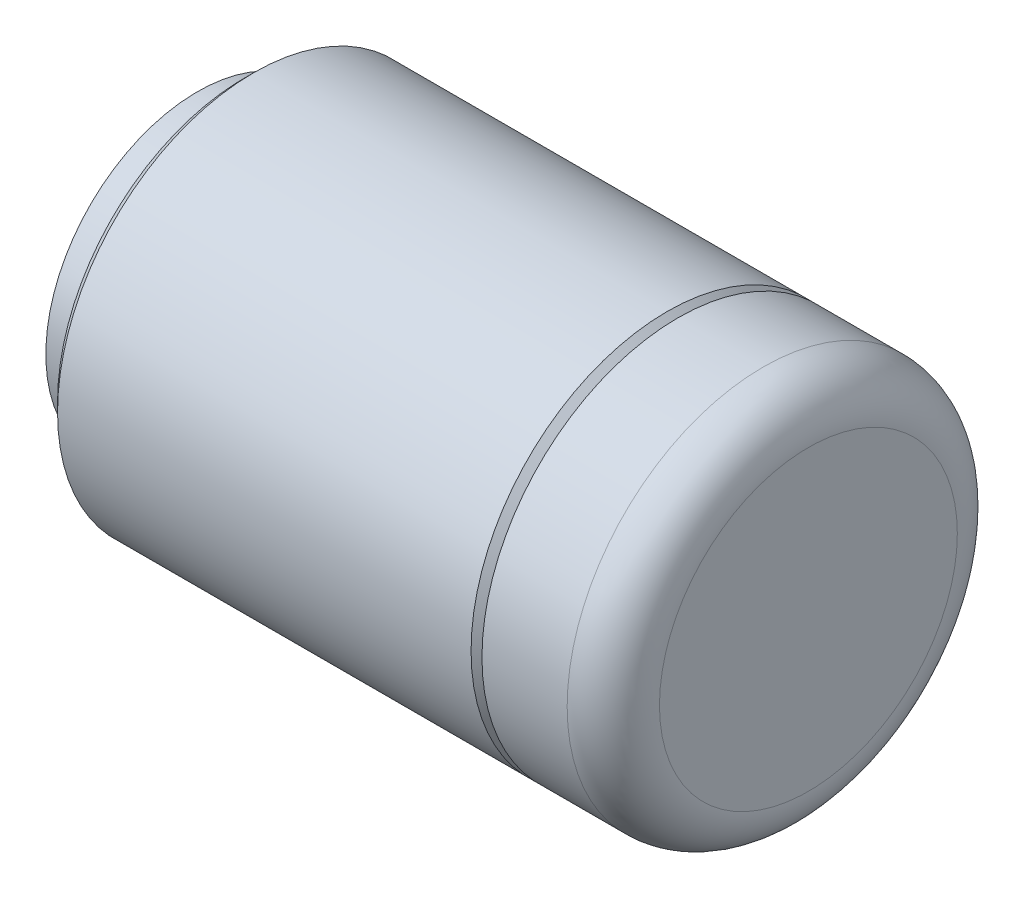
ISO-10303-21;
HEADER;
FILE_DESCRIPTION(('STEP AP214'),'2;1');
FILE_NAME('part.step','',(''),(''),'','','');
FILE_SCHEMA(('AUTOMOTIVE_DESIGN { 1 0 10303 214 1 1 1 1 }'));
ENDSEC;
DATA;
#1=APPLICATION_CONTEXT('core data for automotive mechanical design processes');
#2=APPLICATION_PROTOCOL_DEFINITION('international standard','automotive_design',2000,#1);
#3=PRODUCT_CONTEXT('',#1,'mechanical');
#4=PRODUCT('Part','Part','',(#3));
#5=PRODUCT_RELATED_PRODUCT_CATEGORY('part','',(#4));
#6=PRODUCT_DEFINITION_FORMATION('','',#4);
#7=PRODUCT_DEFINITION_CONTEXT('part definition',#1,'design');
#8=PRODUCT_DEFINITION('design','',#6,#7);
#9=PRODUCT_DEFINITION_SHAPE('','',#8);
#10=(LENGTH_UNIT() NAMED_UNIT(*) SI_UNIT(.MILLI.,.METRE.));
#11=(NAMED_UNIT(*) PLANE_ANGLE_UNIT() SI_UNIT($,.RADIAN.));
#12=(NAMED_UNIT(*) SI_UNIT($,.STERADIAN.) SOLID_ANGLE_UNIT());
#13=UNCERTAINTY_MEASURE_WITH_UNIT(LENGTH_MEASURE(1.E-05),#10,'distance_accuracy_value','');
#14=(GEOMETRIC_REPRESENTATION_CONTEXT(3) GLOBAL_UNCERTAINTY_ASSIGNED_CONTEXT((#13)) GLOBAL_UNIT_ASSIGNED_CONTEXT((#10,
#11,#12)) REPRESENTATION_CONTEXT('',''));
#15=CARTESIAN_POINT('',(0.,0.,0.));
#16=DIRECTION('',(0.,0.,1.));
#17=DIRECTION('',(1.,0.,0.));
#18=AXIS2_PLACEMENT_3D('',#15,#16,#17);
#19=CARTESIAN_POINT('',(155.999999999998,0.,34.9999999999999));
#20=DIRECTION('',(-1.,0.,0.));
#21=DIRECTION('',(0.,0.,1.));
#22=AXIS2_PLACEMENT_3D('',#19,#20,#21);
#23=PLANE('',#22);
#24=CARTESIAN_POINT('',(155.999999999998,0.,0.));
#25=DIRECTION('',(1.,0.,0.));
#26=DIRECTION('',(0.,0.,-1.));
#27=AXIS2_PLACEMENT_3D('',#24,#25,#26);
#28=CIRCLE('',#27,69.9999999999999);
#29=CARTESIAN_POINT('',(155.999999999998,0.,-69.9999999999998));
#30=VERTEX_POINT('',#29);
#31=EDGE_CURVE('E18',#30,#30,#28,.T.);
#32=ORIENTED_EDGE('',*,*,#31,.F.);
#33=EDGE_LOOP('',(#32));
#34=FACE_BOUND('',#33,.T.);
#35=ADVANCED_FACE('F14',(#34),#23,.T.);
#36=CARTESIAN_POINT('',(155.999999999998,0.,0.));
#37=DIRECTION('',(1.,0.,0.));
#38=DIRECTION('',(0.,0.,-1.));
#39=AXIS2_PLACEMENT_3D('',#36,#37,#38);
#40=CYLINDRICAL_SURFACE('',#39,69.9999999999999);
#41=CARTESIAN_POINT('',(166.999999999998,0.,0.));
#42=DIRECTION('',(1.,0.,0.));
#43=DIRECTION('',(0.,0.,1.));
#44=AXIS2_PLACEMENT_3D('',#41,#42,#43);
#45=CIRCLE('',#44,69.9999999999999);
#46=CARTESIAN_POINT('',(166.999999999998,0.,69.9999999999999));
#47=VERTEX_POINT('',#46);
#48=EDGE_CURVE('E30',#47,#47,#45,.T.);
#49=ORIENTED_EDGE('',*,*,#48,.F.);
#50=EDGE_LOOP('',(#49));
#51=FACE_BOUND('',#50,.T.);
#52=ORIENTED_EDGE('',*,*,#31,.T.);
#53=EDGE_LOOP('',(#52));
#54=FACE_BOUND('',#53,.T.);
#55=ADVANCED_FACE('F46',(#51,#54),#40,.T.);
#56=CARTESIAN_POINT('',(177.758875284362,0.,0.));
#57=DIRECTION('',(1.,0.,0.));
#58=DIRECTION('',(0.,0.,-1.));
#59=AXIS2_PLACEMENT_3D('',#56,#57,#58);
#60=CONICAL_SURFACE('',#59,84.350199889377,0.927463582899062);
#61=CARTESIAN_POINT('',(177.758875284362,0.,0.));
#62=DIRECTION('',(1.,0.,0.));
#63=DIRECTION('',(0.,0.,-1.));
#64=AXIS2_PLACEMENT_3D('',#61,#62,#63);
#65=CIRCLE('',#64,84.350199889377);
#66=CARTESIAN_POINT('',(177.758875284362,0.,-84.350199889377));
#67=VERTEX_POINT('',#66);
#68=EDGE_CURVE('E36',#67,#67,#65,.T.);
#69=ORIENTED_EDGE('',*,*,#68,.F.);
#70=EDGE_LOOP('',(#69));
#71=FACE_BOUND('',#70,.T.);
#72=ORIENTED_EDGE('',*,*,#48,.T.);
#73=EDGE_LOOP('',(#72));
#74=FACE_BOUND('',#73,.T.);
#75=ADVANCED_FACE('F53',(#71,#74),#60,.T.);
#76=CARTESIAN_POINT('',(177.758875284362,0.,85.3533239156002));
#77=DIRECTION('',(-1.,0.,0.));
#78=DIRECTION('',(0.,0.,1.));
#79=AXIS2_PLACEMENT_3D('',#76,#77,#78);
#80=PLANE('',#79);
#81=ORIENTED_EDGE('',*,*,#68,.T.);
#82=EDGE_LOOP('',(#81));
#83=FACE_BOUND('',#82,.T.);
#84=CARTESIAN_POINT('',(177.758875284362,0.,0.));
#85=DIRECTION('',(1.,0.,0.));
#86=DIRECTION('',(0.,0.,-1.));
#87=AXIS2_PLACEMENT_3D('',#84,#85,#86);
#88=CIRCLE('',#87,86.3564479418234);
#89=CARTESIAN_POINT('',(177.758875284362,0.,-86.3564479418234));
#90=VERTEX_POINT('',#89);
#91=EDGE_CURVE('E33',#90,#90,#88,.T.);
#92=ORIENTED_EDGE('',*,*,#91,.F.);
#93=EDGE_LOOP('',(#92));
#94=FACE_BOUND('',#93,.T.);
#95=ADVANCED_FACE('F109',(#83,#94),#80,.T.);
#96=CARTESIAN_POINT('',(437.99999999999,0.,34.3753541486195));
#97=DIRECTION('',(1.,0.,0.));
#98=DIRECTION('',(0.,0.,-1.));
#99=AXIS2_PLACEMENT_3D('',#96,#97,#98);
#100=PLANE('',#99);
#101=CARTESIAN_POINT('',(437.999999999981,0.,0.));
#102=DIRECTION('',(-1.,0.,0.));
#103=DIRECTION('',(0.,0.,1.));
#104=AXIS2_PLACEMENT_3D('',#101,#102,#103);
#105=CIRCLE('',#104,68.750708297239);
#106=CARTESIAN_POINT('',(437.999999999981,0.,68.7507082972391));
#107=VERTEX_POINT('',#106);
#108=EDGE_CURVE('E35',#107,#107,#105,.T.);
#109=ORIENTED_EDGE('',*,*,#108,.F.);
#110=EDGE_LOOP('',(#109));
#111=FACE_BOUND('',#110,.T.);
#112=ADVANCED_FACE('F107',(#111),#100,.T.);
#113=CARTESIAN_POINT('',(181.90242734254,0.,0.));
#114=DIRECTION('',(1.,0.,0.));
#115=DIRECTION('',(0.,0.,-1.));
#116=AXIS2_PLACEMENT_3D('',#113,#114,#115);
#117=CONICAL_SURFACE('',#116,90.4999999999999,0.785398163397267);
#118=CARTESIAN_POINT('',(181.90242734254,0.,0.));
#119=DIRECTION('',(1.,0.,0.));
#120=DIRECTION('',(0.,0.,1.));
#121=AXIS2_PLACEMENT_3D('',#118,#119,#120);
#122=CIRCLE('',#121,90.4999999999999);
#123=CARTESIAN_POINT('',(181.90242734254,0.,90.4999999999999));
#124=VERTEX_POINT('',#123);
#125=EDGE_CURVE('E93',#124,#124,#122,.T.);
#126=ORIENTED_EDGE('',*,*,#125,.F.);
#127=EDGE_LOOP('',(#126));
#128=FACE_BOUND('',#127,.T.);
#129=ORIENTED_EDGE('',*,*,#91,.T.);
#130=EDGE_LOOP('',(#129));
#131=FACE_BOUND('',#130,.T.);
#132=ADVANCED_FACE('F80',(#128,#131),#117,.T.);
#133=CARTESIAN_POINT('',(417.143429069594,0.,0.));
#134=DIRECTION('',(1.,0.,0.));
#135=DIRECTION('',(0.,0.,1.));
#136=AXIS2_PLACEMENT_3D('',#133,#134,#135);
#137=TOROIDAL_SURFACE('',#136,69.6251077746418,20.8748922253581);
#138=CARTESIAN_POINT('',(417.143429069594,0.,0.));
#139=DIRECTION('',(1.,0.,0.));
#140=DIRECTION('',(0.,0.,1.));
#141=AXIS2_PLACEMENT_3D('',#138,#139,#140);
#142=CIRCLE('',#141,90.4999999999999);
#143=CARTESIAN_POINT('',(417.143429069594,0.,90.4999999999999));
#144=VERTEX_POINT('',#143);
#145=EDGE_CURVE('E91',#144,#144,#142,.F.);
#146=ORIENTED_EDGE('',*,*,#145,.F.);
#147=EDGE_LOOP('',(#146));
#148=FACE_BOUND('',#147,.T.);
#149=ORIENTED_EDGE('',*,*,#108,.T.);
#150=EDGE_LOOP('',(#149));
#151=FACE_BOUND('',#150,.T.);
#152=ADVANCED_FACE('F71',(#148,#151),#137,.T.);
#153=CARTESIAN_POINT('',(181.90242734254,0.,0.));
#154=DIRECTION('',(1.,0.,0.));
#155=DIRECTION('',(0.,0.,-1.));
#156=AXIS2_PLACEMENT_3D('',#153,#154,#155);
#157=CYLINDRICAL_SURFACE('',#156,90.4999999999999);
#158=CARTESIAN_POINT('',(372.789300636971,0.,0.));
#159=DIRECTION('',(-1.,0.,0.));
#160=DIRECTION('',(0.,0.,1.));
#161=AXIS2_PLACEMENT_3D('',#158,#159,#160);
#162=CIRCLE('',#161,90.4999999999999);
#163=CARTESIAN_POINT('',(372.789300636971,0.,90.4999999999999));
#164=VERTEX_POINT('',#163);
#165=EDGE_CURVE('E27',#164,#164,#162,.F.);
#166=ORIENTED_EDGE('',*,*,#165,.F.);
#167=EDGE_LOOP('',(#166));
#168=FACE_BOUND('',#167,.T.);
#169=ORIENTED_EDGE('',*,*,#125,.T.);
#170=EDGE_LOOP('',(#169));
#171=FACE_BOUND('',#170,.T.);
#172=ADVANCED_FACE('F66',(#168,#171),#157,.T.);
#173=CARTESIAN_POINT('',(377.813050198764,0.,0.));
#174=DIRECTION('',(1.,0.,0.));
#175=DIRECTION('',(0.,0.,-1.));
#176=AXIS2_PLACEMENT_3D('',#173,#174,#175);
#177=CYLINDRICAL_SURFACE('',#176,90.4999999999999);
#178=ORIENTED_EDGE('',*,*,#145,.T.);
#179=EDGE_LOOP('',(#178));
#180=FACE_BOUND('',#179,.T.);
#181=CARTESIAN_POINT('',(377.813050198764,0.,0.));
#182=DIRECTION('',(1.,0.,0.));
#183=DIRECTION('',(0.,0.,-1.));
#184=AXIS2_PLACEMENT_3D('',#181,#182,#183);
#185=CIRCLE('',#184,90.4999999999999);
#186=CARTESIAN_POINT('',(377.813050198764,0.,-90.4999999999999));
#187=VERTEX_POINT('',#186);
#188=EDGE_CURVE('E22',#187,#187,#185,.F.);
#189=ORIENTED_EDGE('',*,*,#188,.F.);
#190=EDGE_LOOP('',(#189));
#191=FACE_BOUND('',#190,.T.);
#192=ADVANCED_FACE('F60',(#180,#191),#177,.T.);
#193=CARTESIAN_POINT('',(372.789300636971,0.,0.));
#194=DIRECTION('',(-1.,0.,0.));
#195=DIRECTION('',(0.,0.,1.));
#196=AXIS2_PLACEMENT_3D('',#193,#194,#195);
#197=CONICAL_SURFACE('',#196,90.4999999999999,0.78539816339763);
#198=CARTESIAN_POINT('',(377.813050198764,0.,0.));
#199=DIRECTION('',(-1.,0.,0.));
#200=DIRECTION('',(0.,0.,1.));
#201=AXIS2_PLACEMENT_3D('',#198,#199,#200);
#202=CIRCLE('',#201,85.4762504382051);
#203=CARTESIAN_POINT('',(377.813050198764,0.,85.4762504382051));
#204=VERTEX_POINT('',#203);
#205=EDGE_CURVE('E9',#204,#204,#202,.F.);
#206=ORIENTED_EDGE('',*,*,#205,.F.);
#207=EDGE_LOOP('',(#206));
#208=FACE_BOUND('',#207,.T.);
#209=ORIENTED_EDGE('',*,*,#165,.T.);
#210=EDGE_LOOP('',(#209));
#211=FACE_BOUND('',#210,.T.);
#212=ADVANCED_FACE('F57',(#208,#211),#197,.T.);
#213=CARTESIAN_POINT('',(377.813050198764,0.,87.9881252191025));
#214=DIRECTION('',(-1.,0.,0.));
#215=DIRECTION('',(0.,0.,1.));
#216=AXIS2_PLACEMENT_3D('',#213,#214,#215);
#217=PLANE('',#216);
#218=ORIENTED_EDGE('',*,*,#205,.T.);
#219=EDGE_LOOP('',(#218));
#220=FACE_BOUND('',#219,.T.);
#221=ORIENTED_EDGE('',*,*,#188,.T.);
#222=EDGE_LOOP('',(#221));
#223=FACE_BOUND('',#222,.T.);
#224=ADVANCED_FACE('F16',(#220,#223),#217,.T.);
#225=CLOSED_SHELL('',(#35,#55,#75,#95,#112,#132,#152,#172,#192,#212,#224));
#226=MANIFOLD_SOLID_BREP('B1',#225);
#227=ADVANCED_BREP_SHAPE_REPRESENTATION('',(#18,#226),#14);
#228=SHAPE_DEFINITION_REPRESENTATION(#9,#227);
ENDSEC;
END-ISO-10303-21;
